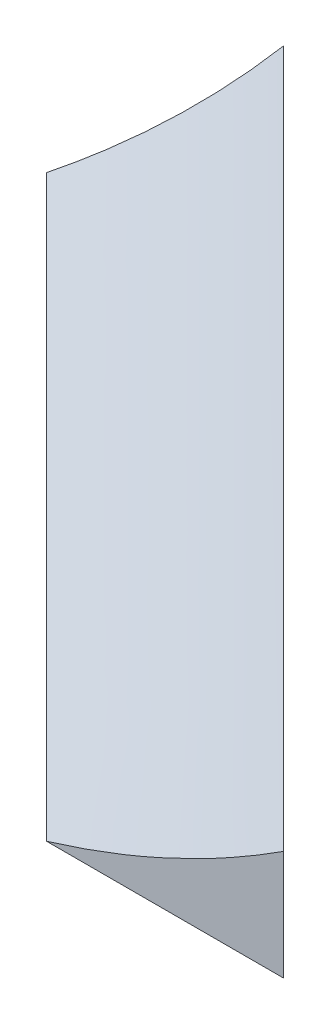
ISO-10303-21;
HEADER;
FILE_DESCRIPTION(('STEP AP214'),'2;1');
FILE_NAME('part.step','',(''),(''),'','','');
FILE_SCHEMA(('AUTOMOTIVE_DESIGN { 1 0 10303 214 1 1 1 1 }'));
ENDSEC;
DATA;
#1=APPLICATION_CONTEXT('core data for automotive mechanical design processes');
#2=APPLICATION_PROTOCOL_DEFINITION('international standard','automotive_design',2000,#1);
#3=PRODUCT_CONTEXT('',#1,'mechanical');
#4=PRODUCT('Part','Part','',(#3));
#5=PRODUCT_RELATED_PRODUCT_CATEGORY('part','',(#4));
#6=PRODUCT_DEFINITION_FORMATION('','',#4);
#7=PRODUCT_DEFINITION_CONTEXT('part definition',#1,'design');
#8=PRODUCT_DEFINITION('design','',#6,#7);
#9=PRODUCT_DEFINITION_SHAPE('','',#8);
#10=(LENGTH_UNIT() NAMED_UNIT(*) SI_UNIT(.MILLI.,.METRE.));
#11=(NAMED_UNIT(*) PLANE_ANGLE_UNIT() SI_UNIT($,.RADIAN.));
#12=(NAMED_UNIT(*) SI_UNIT($,.STERADIAN.) SOLID_ANGLE_UNIT());
#13=UNCERTAINTY_MEASURE_WITH_UNIT(LENGTH_MEASURE(1.E-05),#10,'distance_accuracy_value','');
#14=(GEOMETRIC_REPRESENTATION_CONTEXT(3) GLOBAL_UNCERTAINTY_ASSIGNED_CONTEXT((#13)) GLOBAL_UNIT_ASSIGNED_CONTEXT((#10,
#11,#12)) REPRESENTATION_CONTEXT('',''));
#15=CARTESIAN_POINT('',(0.,0.,0.));
#16=DIRECTION('',(0.,0.,1.));
#17=DIRECTION('',(1.,0.,0.));
#18=AXIS2_PLACEMENT_3D('',#15,#16,#17);
#19=CARTESIAN_POINT('',(136.966061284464,487.480000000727,0.));
#20=DIRECTION('',(0.,-1.,0.));
#21=DIRECTION('',(0.,0.,1.));
#22=AXIS2_PLACEMENT_3D('',#19,#20,#21);
#23=PLANE('',#22);
#24=DIRECTION('',(-0.707106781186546,0.,-0.707106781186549));
#25=VECTOR('',#24,1.);
#26=CARTESIAN_POINT('',(-183.203481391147,487.480000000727,-198.499998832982));
#27=LINE('',#26,#25);
#28=CARTESIAN_POINT('',(-199.051741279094,487.480000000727,-214.348258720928));
#29=VERTEX_POINT('',#28);
#30=CARTESIAN_POINT('',(-183.203481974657,487.480000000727,-198.499999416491));
#31=VERTEX_POINT('',#30);
#32=EDGE_CURVE('E66',#29,#31,#27,.F.);
#33=ORIENTED_EDGE('',*,*,#32,.F.);
#34=DIRECTION('',(0.70710678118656,0.,-0.707106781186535));
#35=VECTOR('',#34,1.);
#36=CARTESIAN_POINT('',(-195.81137092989,487.480000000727,-217.588629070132));
#37=LINE('',#36,#35);
#38=CARTESIAN_POINT('',(-195.81137092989,487.480000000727,-217.588629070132));
#39=VERTEX_POINT('',#38);
#40=EDGE_CURVE('E135',#29,#39,#37,.T.);
#41=ORIENTED_EDGE('',*,*,#40,.T.);
#42=DIRECTION('',(-0.707106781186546,0.,-0.707106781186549));
#43=VECTOR('',#42,1.);
#44=CARTESIAN_POINT('',(-176.722741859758,487.480000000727,-198.5));
#45=LINE('',#44,#43);
#46=CARTESIAN_POINT('',(-176.722741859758,487.480000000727,-198.5));
#47=VERTEX_POINT('',#46);
#48=EDGE_CURVE('E92',#47,#39,#45,.T.);
#49=ORIENTED_EDGE('',*,*,#48,.F.);
#50=DIRECTION('',(1.,0.,0.));
#51=VECTOR('',#50,1.);
#52=CARTESIAN_POINT('',(-200.,487.480000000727,-198.5));
#53=LINE('',#52,#51);
#54=EDGE_CURVE('E95',#31,#47,#53,.T.);
#55=ORIENTED_EDGE('',*,*,#54,.F.);
#56=EDGE_LOOP('',(#33,#41,#49,#55));
#57=FACE_BOUND('',#56,.T.);
#58=ADVANCED_FACE('F63',(#57),#23,.T.);
#59=CARTESIAN_POINT('',(-203.192618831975,501.425317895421,-210.207381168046));
#60=DIRECTION('',(0.70710678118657,0.,0.707106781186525));
#61=DIRECTION('',(0.707106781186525,0.,-0.70710678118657));
#62=AXIS2_PLACEMENT_3D('',#59,#60,#61);
#63=PLANE('',#62);
#64=DIRECTION('',(0.,-1.,0.));
#65=VECTOR('',#64,1.);
#66=CARTESIAN_POINT('',(-195.81137092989,487.480000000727,-217.588629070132));
#67=LINE('',#66,#65);
#68=CARTESIAN_POINT('',(-195.81137092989,490.480000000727,-217.588629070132));
#69=VERTEX_POINT('',#68);
#70=EDGE_CURVE('E134',#39,#69,#67,.F.);
#71=ORIENTED_EDGE('',*,*,#70,.F.);
#72=ORIENTED_EDGE('',*,*,#40,.F.);
#73=CARTESIAN_POINT('',(-195.81137092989,490.480000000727,-217.588629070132));
#74=CARTESIAN_POINT('',(-195.964989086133,490.272792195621,-217.435010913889));
#75=CARTESIAN_POINT('',(-196.122978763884,490.072070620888,-217.277021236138));
#76=CARTESIAN_POINT('',(-196.447118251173,489.684274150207,-216.952881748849));
#77=CARTESIAN_POINT('',(-196.61326796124,489.497199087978,-216.786732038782));
#78=CARTESIAN_POINT('',(-196.956722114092,489.133581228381,-216.44327788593));
#79=CARTESIAN_POINT('',(-197.134187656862,488.957342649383,-216.26581234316));
#80=CARTESIAN_POINT('',(-197.496363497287,488.620438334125,-215.903636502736));
#81=CARTESIAN_POINT('',(-197.681073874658,488.459772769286,-215.718926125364));
#82=CARTESIAN_POINT('',(-198.059907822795,488.152300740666,-215.340092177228));
#83=CARTESIAN_POINT('',(-198.254131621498,488.005741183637,-215.145868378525));
#84=CARTESIAN_POINT('',(-198.648605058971,487.729827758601,-214.751394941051));
#85=CARTESIAN_POINT('',(-198.848854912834,487.600474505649,-214.551145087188));
#86=CARTESIAN_POINT('',(-199.051741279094,487.480000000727,-214.348258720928));
#87=B_SPLINE_CURVE_WITH_KNOTS('',3,(#73,#74,#75,#76,#77,#78,#79,#80,#81,#82,#83,#84,#85,#86),
.UNSPECIFIED.,.F.,.F.,(4,2,2,2,2,2,4),(0.,0.900522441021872,1.80103390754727,2.72048258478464,
3.63994138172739,4.57333317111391,5.50675831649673),.UNSPECIFIED.);
#88=EDGE_CURVE('E106',#69,#29,#87,.T.);
#89=ORIENTED_EDGE('',*,*,#88,.F.);
#90=EDGE_LOOP('',(#71,#72,#89));
#91=FACE_BOUND('',#90,.T.);
#92=ADVANCED_FACE('F112',(#91),#63,.F.);
#93=CARTESIAN_POINT('',(-176.722741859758,487.480000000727,-198.5));
#94=DIRECTION('',(-0.707106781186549,0.,0.707106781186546));
#95=DIRECTION('',(-0.707106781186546,0.,-0.707106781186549));
#96=AXIS2_PLACEMENT_3D('',#93,#94,#95);
#97=PLANE('',#96);
#98=DIRECTION('',(0.,1.,0.));
#99=VECTOR('',#98,1.);
#100=CARTESIAN_POINT('',(-176.722741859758,487.480000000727,-198.5));
#101=LINE('',#100,#99);
#102=CARTESIAN_POINT('',(-176.722741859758,490.480000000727,-198.5));
#103=VERTEX_POINT('',#102);
#104=EDGE_CURVE('E99',#47,#103,#101,.T.);
#105=ORIENTED_EDGE('',*,*,#104,.F.);
#106=ORIENTED_EDGE('',*,*,#48,.T.);
#107=ORIENTED_EDGE('',*,*,#70,.T.);
#108=DIRECTION('',(-0.707106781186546,0.,-0.707106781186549));
#109=VECTOR('',#108,1.);
#110=CARTESIAN_POINT('',(-176.722741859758,490.480000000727,-198.5));
#111=LINE('',#110,#109);
#112=EDGE_CURVE('E72',#103,#69,#111,.T.);
#113=ORIENTED_EDGE('',*,*,#112,.F.);
#114=EDGE_LOOP('',(#105,#106,#107,#113));
#115=FACE_BOUND('',#114,.T.);
#116=ADVANCED_FACE('F149',(#115),#97,.F.);
#117=CARTESIAN_POINT('',(-190.622742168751,512.007429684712,-198.499997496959));
#118=DIRECTION('',(1.80074923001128E-07,0.,0.999999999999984));
#119=DIRECTION('',(0.999999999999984,0.,-1.80074923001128E-07));
#120=AXIS2_PLACEMENT_3D('',#117,#118,#119);
#121=PLANE('',#120);
#122=ORIENTED_EDGE('',*,*,#104,.T.);
#123=CARTESIAN_POINT('',(-183.203481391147,487.480000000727,-198.499998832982));
#124=CARTESIAN_POINT('',(-182.916539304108,487.566796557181,-198.499998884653));
#125=CARTESIAN_POINT('',(-182.631144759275,487.658621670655,-198.499998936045));
#126=CARTESIAN_POINT('',(-182.063775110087,487.85221966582,-198.499999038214));
#127=CARTESIAN_POINT('',(-181.781799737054,487.953991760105,-198.499999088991));
#128=CARTESIAN_POINT('',(-180.941485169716,488.274061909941,-198.499999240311));
#129=CARTESIAN_POINT('',(-180.388691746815,488.507133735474,-198.499999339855));
#130=CARTESIAN_POINT('',(-179.30546595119,489.009324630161,-198.499999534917));
#131=CARTESIAN_POINT('',(-178.774883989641,489.278122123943,-198.499999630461));
#132=CARTESIAN_POINT('',(-177.733359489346,489.852108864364,-198.499999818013));
#133=CARTESIAN_POINT('',(-177.222429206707,490.157320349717,-198.499999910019));
#134=CARTESIAN_POINT('',(-176.722741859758,490.480000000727,-198.5));
#135=B_SPLINE_CURVE_WITH_KNOTS('',3,(#123,#124,#125,#126,#127,#128,#129,#130,#131,#132,#133,
#134),.UNSPECIFIED.,.F.,.F.,(4,2,2,2,2,4),(0.,0.899250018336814,1.7984289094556,
3.59658097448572,5.37952362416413,7.1635607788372),.UNSPECIFIED.);
#136=EDGE_CURVE('E12',#31,#103,#135,.T.);
#137=ORIENTED_EDGE('',*,*,#136,.F.);
#138=ORIENTED_EDGE('',*,*,#54,.T.);
#139=EDGE_LOOP('',(#122,#137,#138));
#140=FACE_BOUND('',#139,.T.);
#141=ADVANCED_FACE('F101',(#140),#121,.T.);
#142=CARTESIAN_POINT('',(-183.203481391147,487.480000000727,-198.499998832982));
#143=CARTESIAN_POINT('',(-183.863825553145,487.480000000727,-199.160342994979));
#144=CARTESIAN_POINT('',(-185.184513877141,487.480000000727,-200.481031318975));
#145=CARTESIAN_POINT('',(-186.629530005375,487.480000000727,-201.926047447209));
#146=CARTESIAN_POINT('',(-187.730103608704,487.480000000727,-203.026621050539));
#147=CARTESIAN_POINT('',(-188.390447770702,487.480000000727,-203.686965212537));
#148=CARTESIAN_POINT('',(-189.486944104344,487.480000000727,-204.783461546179));
#149=CARTESIAN_POINT('',(-190.367402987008,487.480000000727,-205.663920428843));
#150=CARTESIAN_POINT('',(-191.476131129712,487.480000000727,-206.772648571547));
#151=CARTESIAN_POINT('',(-192.236339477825,487.480000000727,-207.532856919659));
#152=CARTESIAN_POINT('',(-193.116798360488,487.480000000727,-208.413315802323));
#153=CARTESIAN_POINT('',(-193.66504652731,487.480000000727,-208.961563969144));
#154=CARTESIAN_POINT('',(-194.325390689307,487.480000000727,-209.621908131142));
#155=CARTESIAN_POINT('',(-194.989812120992,487.480000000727,-210.286329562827));
#156=CARTESIAN_POINT('',(-195.974212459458,487.480000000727,-211.270729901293));
#157=CARTESIAN_POINT('',(-196.746652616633,487.480000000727,-212.043170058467));
#158=CARTESIAN_POINT('',(-197.843148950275,487.480000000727,-213.139666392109));
#159=CARTESIAN_POINT('',(-198.503493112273,487.480000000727,-213.800010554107));
#160=CARTESIAN_POINT('',(-199.051741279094,487.480000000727,-214.348258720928));
#161=CARTESIAN_POINT('',(-180.910048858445,488.173736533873,-198.499999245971));
#162=CARTESIAN_POINT('',(-181.614422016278,488.182584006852,-199.252208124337));
#163=CARTESIAN_POINT('',(-183.045592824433,488.200456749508,-200.780011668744));
#164=CARTESIAN_POINT('',(-184.580259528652,488.19519217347,-202.286214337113));
#165=CARTESIAN_POINT('',(-185.753498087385,488.194205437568,-203.454117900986));
#166=CARTESIAN_POINT('',(-186.459210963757,488.194385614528,-204.160804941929));
#167=CARTESIAN_POINT('',(-187.632260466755,488.195002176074,-205.337188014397));
#168=CARTESIAN_POINT('',(-188.572280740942,488.194854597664,-206.276410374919));
#169=CARTESIAN_POINT('',(-189.756081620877,488.194720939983,-207.459488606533));
#170=CARTESIAN_POINT('',(-190.568142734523,488.194733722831,-208.271618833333));
#171=CARTESIAN_POINT('',(-191.508758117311,488.194768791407,-209.212423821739));
#172=CARTESIAN_POINT('',(-192.094400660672,488.194774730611,-209.798098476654));
#173=CARTESIAN_POINT('',(-192.799744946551,488.194773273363,-210.503434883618));
#174=CARTESIAN_POINT('',(-193.509406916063,488.194764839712,-211.213051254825));
#175=CARTESIAN_POINT('',(-194.560881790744,488.194762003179,-212.264510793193));
#176=CARTESIAN_POINT('',(-195.385983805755,488.194765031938,-213.089629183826));
#177=CARTESIAN_POINT('',(-196.557221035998,488.194766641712,-214.260875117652));
#178=CARTESIAN_POINT('',(-197.262566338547,488.194765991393,-214.966216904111));
#179=CARTESIAN_POINT('',(-197.848176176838,488.194765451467,-215.551823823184));
#180=CARTESIAN_POINT('',(-178.7356599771,489.180283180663,-198.499999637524));
#181=CARTESIAN_POINT('',(-179.483850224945,489.191064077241,-199.300202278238));
#182=CARTESIAN_POINT('',(-181.011805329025,489.212842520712,-200.933227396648));
#183=CARTESIAN_POINT('',(-182.64169548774,489.206427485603,-202.532168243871));
#184=CARTESIAN_POINT('',(-183.889448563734,489.205225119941,-203.774120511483));
#185=CARTESIAN_POINT('',(-184.6402540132,489.205444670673,-204.525985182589));
#186=CARTESIAN_POINT('',(-185.888342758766,489.206195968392,-205.777698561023));
#187=CARTESIAN_POINT('',(-186.888294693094,489.206016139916,-206.776782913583));
#188=CARTESIAN_POINT('',(-188.147592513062,489.205853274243,-208.035294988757));
#189=CARTESIAN_POINT('',(-189.011471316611,489.205868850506,-208.899248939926));
#190=CARTESIAN_POINT('',(-190.012111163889,489.205911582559,-209.900094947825));
#191=CARTESIAN_POINT('',(-190.635122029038,489.205918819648,-210.52314072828));
#192=CARTESIAN_POINT('',(-191.385470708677,489.20591704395,-211.273480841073));
#193=CARTESIAN_POINT('',(-192.14041144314,489.205906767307,-212.028371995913));
#194=CARTESIAN_POINT('',(-193.258975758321,489.205903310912,-213.146919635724));
#195=CARTESIAN_POINT('',(-194.136724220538,489.20590700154,-214.024685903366));
#196=CARTESIAN_POINT('',(-195.382692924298,489.205908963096,-215.270664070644));
#197=CARTESIAN_POINT('',(-196.133043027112,489.205908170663,-216.021010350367));
#198=CARTESIAN_POINT('',(-196.756017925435,489.205907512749,-216.643982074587));
#199=CARTESIAN_POINT('',(-176.722741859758,490.480000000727,-198.5));
#200=CARTESIAN_POINT('',(-177.518101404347,490.480000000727,-199.295359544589));
#201=CARTESIAN_POINT('',(-179.108820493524,490.480000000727,-200.886078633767));
#202=CARTESIAN_POINT('',(-180.849287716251,490.480000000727,-202.626545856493));
#203=CARTESIAN_POINT('',(-182.174886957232,490.480000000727,-203.952145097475));
#204=CARTESIAN_POINT('',(-182.970246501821,490.480000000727,-204.747504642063));
#205=CARTESIAN_POINT('',(-184.290934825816,490.480000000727,-206.068192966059));
#206=CARTESIAN_POINT('',(-185.351414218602,490.480000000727,-207.128672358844));
#207=CARTESIAN_POINT('',(-186.686835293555,490.480000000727,-208.464093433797));
#208=CARTESIAN_POINT('',(-187.602477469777,490.480000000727,-209.379735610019));
#209=CARTESIAN_POINT('',(-188.662956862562,490.480000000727,-210.440215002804));
#210=CARTESIAN_POINT('',(-189.32330102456,490.480000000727,-211.100559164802));
#211=CARTESIAN_POINT('',(-190.118660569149,490.480000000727,-211.895918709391));
#212=CARTESIAN_POINT('',(-190.918931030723,490.480000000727,-212.696189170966));
#213=CARTESIAN_POINT('',(-192.104603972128,490.480000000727,-213.88186211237));
#214=CARTESIAN_POINT('',(-193.034978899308,490.480000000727,-214.81223703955));
#215=CARTESIAN_POINT('',(-194.355667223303,490.480000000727,-216.132925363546));
#216=CARTESIAN_POINT('',(-195.151026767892,490.480000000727,-216.928284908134));
#217=CARTESIAN_POINT('',(-195.81137092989,490.480000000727,-217.588629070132));
#218=(BOUNDED_SURFACE() B_SPLINE_SURFACE(3,3,((#142,#143,#144,#145,#146,#147,#148,#149,#150,
#151,#152,#153,#154,#155,#156,#157,#158,#159,#160),(#161,#162,#163,#164,#165,#166,#167,#168,
#169,#170,#171,#172,#173,#174,#175,#176,#177,#178,#179),(#180,#181,#182,#183,#184,#185,#186,
#187,#188,#189,#190,#191,#192,#193,#194,#195,#196,#197,#198),(#199,#200,#201,#202,#203,#204,
#205,#206,#207,#208,#209,#210,#211,#212,#213,#214,#215,#216,#217)),.UNSPECIFIED.,.F.,.F.,
.F.) B_SPLINE_SURFACE_WITH_KNOTS((4,4),(4,1,1,1,1,1,1,1,1,1,1,1,1,1,1,1,4),(0.,1.),(0.,0.125,
0.249999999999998,0.2735346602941,0.333333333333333,0.374999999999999,0.481096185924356,0.5,
0.584876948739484,0.624999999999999,0.666666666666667,0.688657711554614,0.75,0.792438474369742,
0.875,0.896219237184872,1.),
.UNSPECIFIED.) GEOMETRIC_REPRESENTATION_ITEM() RATIONAL_B_SPLINE_SURFACE(((1.,1.,1.,1.,1.,1.,1.,
1.,1.,1.,1.,1.,1.,1.,1.,1.,1.,1.,1.),(0.993495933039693,0.993495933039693,0.98688519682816,
0.988823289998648,0.989187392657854,0.989120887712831,0.988893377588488,0.988947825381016,
0.988997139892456,0.988992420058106,0.988979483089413,0.988977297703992,0.98897784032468,
0.98898094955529,0.988981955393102,0.988980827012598,0.988980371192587,0.988980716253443,
0.988980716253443),(0.993495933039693,0.993495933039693,0.98688519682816,0.988823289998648,
0.989187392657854,0.989120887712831,0.988893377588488,0.988947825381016,0.988997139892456,
0.988992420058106,0.988979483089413,0.988977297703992,0.98897784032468,0.98898094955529,
0.988981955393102,0.988980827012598,0.988980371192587,0.988980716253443,0.988980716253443),(1.,
1.,1.,1.,1.,1.,1.,1.,1.,1.,1.,1.,1.,1.,1.,1.,1.,1.,1.))) REPRESENTATION_ITEM('') SURFACE());
#219=ORIENTED_EDGE('',*,*,#136,.T.);
#220=ORIENTED_EDGE('',*,*,#112,.T.);
#221=ORIENTED_EDGE('',*,*,#88,.T.);
#222=ORIENTED_EDGE('',*,*,#32,.T.);
#223=EDGE_LOOP('',(#219,#220,#221,#222));
#224=FACE_BOUND('',#223,.T.);
#225=ADVANCED_FACE('F105',(#224),#218,.T.);
#226=CLOSED_SHELL('',(#58,#92,#116,#141,#225));
#227=MANIFOLD_SOLID_BREP('B2',#226);
#228=ADVANCED_BREP_SHAPE_REPRESENTATION('',(#18,#227),#14);
#229=SHAPE_DEFINITION_REPRESENTATION(#9,#228);
ENDSEC;
END-ISO-10303-21;
